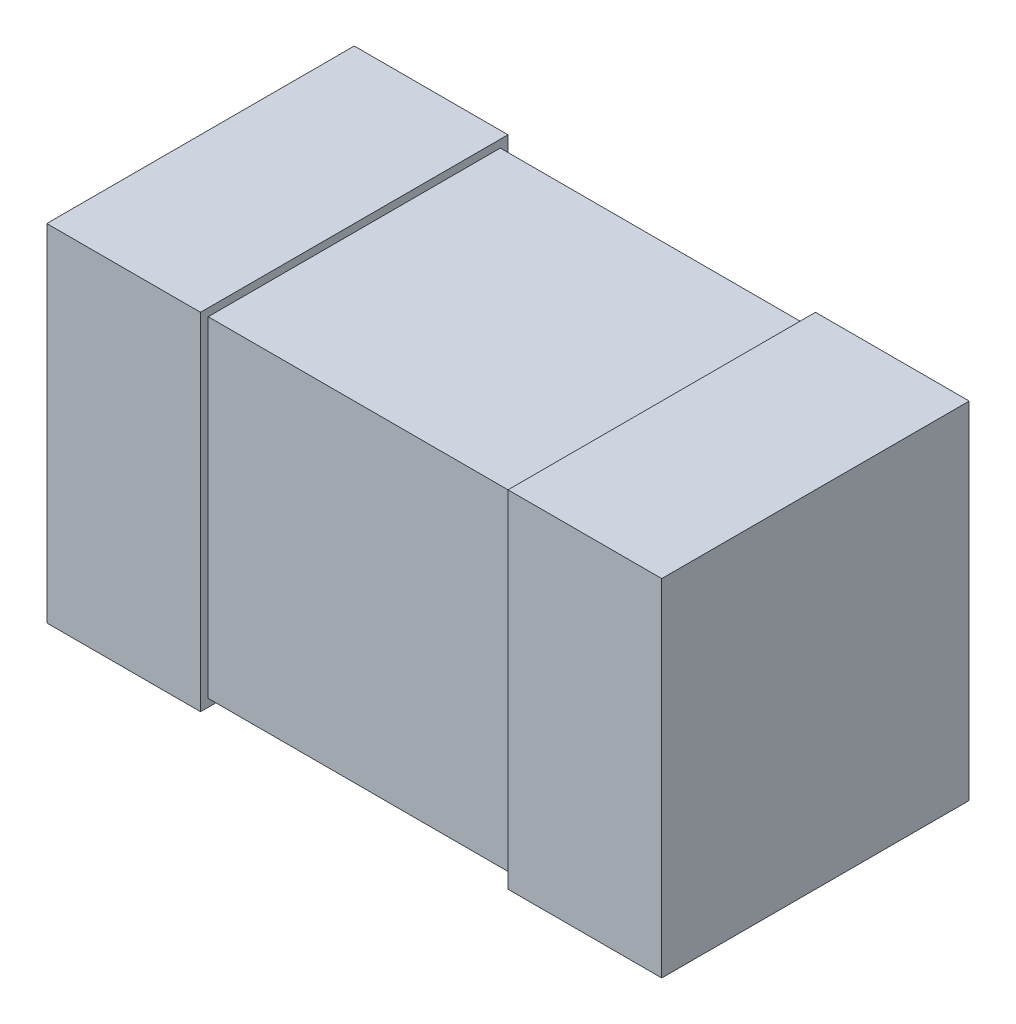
from build123d import *

# Parameters (mm, degrees)
SKETCH_1_W        = 0.4
SKETCH_1_H        = 0.8
EXTRUDE_1_DEPTH   = 0.9
EXTRUDE_1_2_DEPTH = 0.9
SKETCH_2_W        = 0.76
SKETCH_2_H        = 0.86
EXTRUDE_2_DEPTH   = 0.8


with BuildPart() as part:
    # Sketch 1 → Extrude 1 (new body)
    with BuildSketch(Plane(origin=(0, 0, 0), x_dir=(1, 0, 0), z_dir=(0, 1, 0))):
        with Locations((-0.6, 0)):
            Rectangle(SKETCH_1_W, SKETCH_1_H)
    extrude(amount=EXTRUDE_1_DEPTH)



with BuildPart() as body_2:
    # Sketch 1 → Extrude 1 2 (new body)
    with BuildSketch(Plane(origin=(0, 0, 0), x_dir=(1, 0, 0), z_dir=(0, 1, 0))):
        with Locations((0.6, 0)):
            Rectangle(SKETCH_1_W, SKETCH_1_H)
    extrude(amount=EXTRUDE_1_2_DEPTH)


with BuildPart() as part_1:
    add(part.part)

    add(body_2.part)  # Extrude 2 merges body 2
    # Sketch 2 → Extrude 2 (add)
    with BuildSketch(Plane(origin=(-0.4, 0, 0), x_dir=(0, 0, -1), z_dir=(1, 0, 0))):
        with Locations((0, 0.45)):
            Rectangle(SKETCH_2_W, SKETCH_2_H)
    extrude(amount=EXTRUDE_2_DEPTH)


solid = part_1.part
